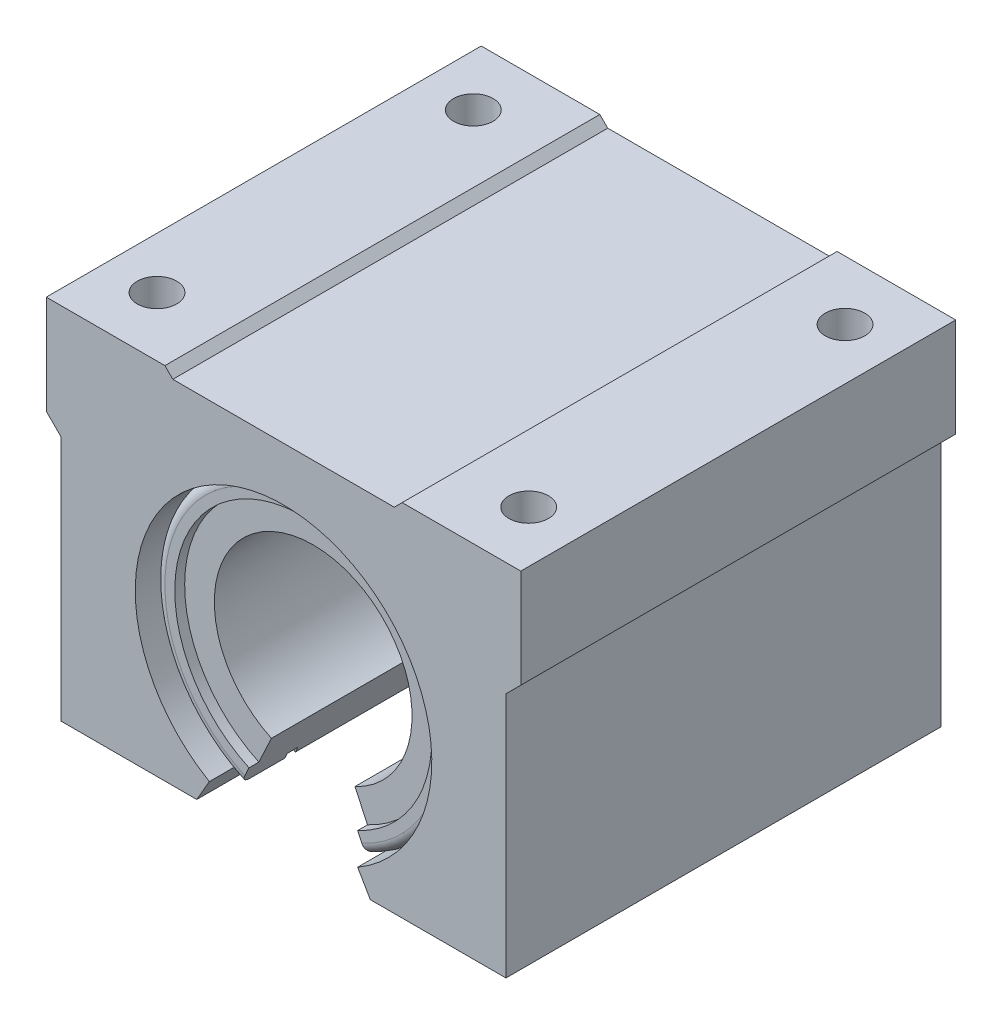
ISO-10303-21;
HEADER;
FILE_DESCRIPTION(('STEP AP214'),'2;1');
FILE_NAME('part.step','',(''),(''),'','','');
FILE_SCHEMA(('AUTOMOTIVE_DESIGN { 1 0 10303 214 1 1 1 1 }'));
ENDSEC;
DATA;
#1=APPLICATION_CONTEXT('core data for automotive mechanical design processes');
#2=APPLICATION_PROTOCOL_DEFINITION('international standard','automotive_design',2000,#1);
#3=PRODUCT_CONTEXT('',#1,'mechanical');
#4=PRODUCT('Part','Part','',(#3));
#5=PRODUCT_RELATED_PRODUCT_CATEGORY('part','',(#4));
#6=PRODUCT_DEFINITION_FORMATION('','',#4);
#7=PRODUCT_DEFINITION_CONTEXT('part definition',#1,'design');
#8=PRODUCT_DEFINITION('design','',#6,#7);
#9=PRODUCT_DEFINITION_SHAPE('','',#8);
#10=(LENGTH_UNIT() NAMED_UNIT(*) SI_UNIT(.MILLI.,.METRE.));
#11=(NAMED_UNIT(*) PLANE_ANGLE_UNIT() SI_UNIT($,.RADIAN.));
#12=(NAMED_UNIT(*) SI_UNIT($,.STERADIAN.) SOLID_ANGLE_UNIT());
#13=UNCERTAINTY_MEASURE_WITH_UNIT(LENGTH_MEASURE(1.E-05),#10,'distance_accuracy_value','');
#14=(GEOMETRIC_REPRESENTATION_CONTEXT(3) GLOBAL_UNCERTAINTY_ASSIGNED_CONTEXT((#13)) GLOBAL_UNIT_ASSIGNED_CONTEXT((#10,
#11,#12)) REPRESENTATION_CONTEXT('',''));
#15=CARTESIAN_POINT('',(0.,0.,0.));
#16=DIRECTION('',(0.,0.,1.));
#17=DIRECTION('',(1.,0.,0.));
#18=AXIS2_PLACEMENT_3D('',#15,#16,#17);
#19=CARTESIAN_POINT('',(0.,0.,50.));
#20=DIRECTION('',(0.,0.,-1.));
#21=DIRECTION('',(-1.,0.,0.));
#22=AXIS2_PLACEMENT_3D('',#19,#20,#21);
#23=CYLINDRICAL_SURFACE('',#22,25.);
#24=DIRECTION('',(0.,0.,-1.));
#25=VECTOR('',#24,1.);
#26=CARTESIAN_POINT('',(10.5654565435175,-22.6576946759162,50.));
#27=LINE('',#26,#25);
#28=CARTESIAN_POINT('',(10.5654565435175,-22.6576946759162,47.5));
#29=VERTEX_POINT('',#28);
#30=CARTESIAN_POINT('',(10.5654565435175,-22.6576946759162,-47.5));
#31=VERTEX_POINT('',#30);
#32=EDGE_CURVE('P0_E38',#29,#31,#27,.T.);
#33=ORIENTED_EDGE('',*,*,#32,.F.);
#34=CARTESIAN_POINT('',(0.,0.,47.5));
#35=DIRECTION('',(0.,0.,1.));
#36=DIRECTION('',(1.,0.,0.));
#37=AXIS2_PLACEMENT_3D('',#34,#35,#36);
#38=CIRCLE('',#37,25.);
#39=CARTESIAN_POINT('',(-10.5654565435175,-22.6576946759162,47.5));
#40=VERTEX_POINT('',#39);
#41=EDGE_CURVE('P0_E168',#29,#40,#38,.T.);
#42=ORIENTED_EDGE('',*,*,#41,.T.);
#43=DIRECTION('',(0.,0.,-1.));
#44=VECTOR('',#43,1.);
#45=CARTESIAN_POINT('',(-10.5654565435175,-22.6576946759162,50.));
#46=LINE('',#45,#44);
#47=CARTESIAN_POINT('',(-10.5654565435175,-22.6576946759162,-47.5));
#48=VERTEX_POINT('',#47);
#49=EDGE_CURVE('P0_E211',#48,#40,#46,.F.);
#50=ORIENTED_EDGE('',*,*,#49,.F.);
#51=CARTESIAN_POINT('',(0.,0.,-47.5));
#52=DIRECTION('',(0.,0.,-1.));
#53=DIRECTION('',(-1.,0.,0.));
#54=AXIS2_PLACEMENT_3D('',#51,#52,#53);
#55=CIRCLE('',#54,25.);
#56=EDGE_CURVE('P0_E166',#48,#31,#55,.T.);
#57=ORIENTED_EDGE('',*,*,#56,.T.);
#58=EDGE_LOOP('',(#33,#42,#50,#57));
#59=FACE_BOUND('',#58,.T.);
#60=ADVANCED_FACE('P0_F16',(#59),#23,.F.);
#61=CARTESIAN_POINT('',(0.,0.,-50.));
#62=DIRECTION('',(0.,0.,1.));
#63=DIRECTION('',(1.,0.,0.));
#64=AXIS2_PLACEMENT_3D('',#61,#62,#63);
#65=PLANE('',#64);
#66=CARTESIAN_POINT('',(0.,0.,-50.));
#67=DIRECTION('',(0.,0.,1.));
#68=DIRECTION('',(1.,0.,0.));
#69=AXIS2_PLACEMENT_3D('',#66,#67,#68);
#70=CIRCLE('',#69,35.);
#71=CARTESIAN_POINT('',(-14.7916391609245,-31.7207725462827,-50.));
#72=VERTEX_POINT('',#71);
#73=CARTESIAN_POINT('',(14.7916391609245,-31.7207725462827,-50.));
#74=VERTEX_POINT('',#73);
#75=EDGE_CURVE('P0_E202',#72,#74,#70,.F.);
#76=ORIENTED_EDGE('',*,*,#75,.T.);
#77=DIRECTION('',(-0.4226182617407,0.90630778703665,0.));
#78=VECTOR('',#77,1.);
#79=CARTESIAN_POINT('',(0.,0.,-50.));
#80=LINE('',#79,#78);
#81=CARTESIAN_POINT('',(13.7350935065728,-29.4550030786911,-50.));
#82=VERTEX_POINT('',#81);
#83=EDGE_CURVE('P0_E159',#74,#82,#80,.T.);
#84=ORIENTED_EDGE('',*,*,#83,.T.);
#85=CARTESIAN_POINT('',(0.,0.,-50.));
#86=DIRECTION('',(0.,0.,1.));
#87=DIRECTION('',(1.,0.,0.));
#88=AXIS2_PLACEMENT_3D('',#85,#86,#87);
#89=CIRCLE('',#88,32.5);
#90=CARTESIAN_POINT('',(-13.7350935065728,-29.4550030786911,-50.));
#91=VERTEX_POINT('',#90);
#92=EDGE_CURVE('P0_E228',#82,#91,#89,.T.);
#93=ORIENTED_EDGE('',*,*,#92,.T.);
#94=DIRECTION('',(-0.4226182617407,-0.90630778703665,0.));
#95=VECTOR('',#94,1.);
#96=CARTESIAN_POINT('',(0.,0.,-50.));
#97=LINE('',#96,#95);
#98=EDGE_CURVE('P0_E258',#91,#72,#97,.T.);
#99=ORIENTED_EDGE('',*,*,#98,.T.);
#100=EDGE_LOOP('',(#76,#84,#93,#99));
#101=FACE_BOUND('',#100,.T.);
#102=ADVANCED_FACE('P0_F257',(#101),#65,.F.);
#103=CARTESIAN_POINT('',(0.,0.,50.));
#104=DIRECTION('',(0.,0.,-1.));
#105=DIRECTION('',(-1.,0.,0.));
#106=AXIS2_PLACEMENT_3D('',#103,#104,#105);
#107=CYLINDRICAL_SURFACE('',#106,37.5);
#108=CARTESIAN_POINT('',(0.,0.,36.15));
#109=DIRECTION('',(0.,0.,1.));
#110=DIRECTION('',(1.,0.,0.));
#111=AXIS2_PLACEMENT_3D('',#108,#109,#110);
#112=CIRCLE('',#111,37.5);
#113=CARTESIAN_POINT('',(15.8481848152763,-33.9865420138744,36.15));
#114=VERTEX_POINT('',#113);
#115=CARTESIAN_POINT('',(-15.8481848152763,-33.9865420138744,36.15));
#116=VERTEX_POINT('',#115);
#117=EDGE_CURVE('P0_E187',#114,#116,#112,.T.);
#118=ORIENTED_EDGE('',*,*,#117,.F.);
#119=DIRECTION('',(0.,0.,1.));
#120=VECTOR('',#119,1.);
#121=CARTESIAN_POINT('',(15.8481848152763,-33.9865420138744,-50.));
#122=LINE('',#121,#120);
#123=CARTESIAN_POINT('',(15.8481848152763,-33.9865420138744,-36.15));
#124=VERTEX_POINT('',#123);
#125=EDGE_CURVE('P0_E268',#124,#114,#122,.T.);
#126=ORIENTED_EDGE('',*,*,#125,.F.);
#127=CARTESIAN_POINT('',(0.,0.,-36.15));
#128=DIRECTION('',(0.,0.,1.));
#129=DIRECTION('',(1.,0.,0.));
#130=AXIS2_PLACEMENT_3D('',#127,#128,#129);
#131=CIRCLE('',#130,37.5);
#132=CARTESIAN_POINT('',(-15.8481848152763,-33.9865420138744,-36.15));
#133=VERTEX_POINT('',#132);
#134=EDGE_CURVE('P0_E184',#124,#133,#131,.T.);
#135=ORIENTED_EDGE('',*,*,#134,.T.);
#136=DIRECTION('',(0.,0.,1.));
#137=VECTOR('',#136,1.);
#138=CARTESIAN_POINT('',(-15.8481848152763,-33.9865420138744,-50.));
#139=LINE('',#138,#137);
#140=EDGE_CURVE('P0_E273',#133,#116,#139,.T.);
#141=ORIENTED_EDGE('',*,*,#140,.T.);
#142=EDGE_LOOP('',(#118,#126,#135,#141));
#143=FACE_BOUND('',#142,.T.);
#144=ADVANCED_FACE('P0_F325',(#143),#107,.T.);
#145=CARTESIAN_POINT('',(0.,0.,-38.8));
#146=DIRECTION('',(0.,0.,1.));
#147=DIRECTION('',(1.,0.,0.));
#148=AXIS2_PLACEMENT_3D('',#145,#146,#147);
#149=CIRCLE('',#148,37.5);
#150=CARTESIAN_POINT('',(15.8481848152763,-33.9865420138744,-38.8));
#151=VERTEX_POINT('',#150);
#152=CARTESIAN_POINT('',(-15.8481848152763,-33.9865420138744,-38.8));
#153=VERTEX_POINT('',#152);
#154=EDGE_CURVE('P0_E181',#151,#153,#149,.T.);
#155=ORIENTED_EDGE('',*,*,#154,.F.);
#156=CARTESIAN_POINT('',(15.8481848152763,-33.9865420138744,-47.5));
#157=VERTEX_POINT('',#156);
#158=EDGE_CURVE('P0_E270',#157,#151,#122,.T.);
#159=ORIENTED_EDGE('',*,*,#158,.F.);
#160=CARTESIAN_POINT('',(0.,0.,-47.5));
#161=DIRECTION('',(0.,0.,1.));
#162=DIRECTION('',(1.,0.,0.));
#163=AXIS2_PLACEMENT_3D('',#160,#161,#162);
#164=CIRCLE('',#163,37.5);
#165=CARTESIAN_POINT('',(-15.8481848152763,-33.9865420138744,-47.5));
#166=VERTEX_POINT('',#165);
#167=EDGE_CURVE('P0_E199',#157,#166,#164,.T.);
#168=ORIENTED_EDGE('',*,*,#167,.T.);
#169=EDGE_CURVE('P0_E269',#166,#153,#139,.T.);
#170=ORIENTED_EDGE('',*,*,#169,.T.);
#171=EDGE_LOOP('',(#155,#159,#168,#170));
#172=FACE_BOUND('',#171,.T.);
#173=ADVANCED_FACE('P0_F333',(#172),#107,.T.);
#174=CARTESIAN_POINT('',(0.,0.,47.5));
#175=DIRECTION('',(0.,0.,1.));
#176=DIRECTION('',(1.,0.,0.));
#177=AXIS2_PLACEMENT_3D('',#174,#175,#176);
#178=CIRCLE('',#177,37.5);
#179=CARTESIAN_POINT('',(-15.8481848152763,-33.9865420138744,47.5));
#180=VERTEX_POINT('',#179);
#181=CARTESIAN_POINT('',(15.8481848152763,-33.9865420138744,47.5));
#182=VERTEX_POINT('',#181);
#183=EDGE_CURVE('P0_E206',#180,#182,#178,.F.);
#184=ORIENTED_EDGE('',*,*,#183,.T.);
#185=CARTESIAN_POINT('',(15.8481848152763,-33.9865420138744,38.8));
#186=VERTEX_POINT('',#185);
#187=EDGE_CURVE('P0_E266',#186,#182,#122,.T.);
#188=ORIENTED_EDGE('',*,*,#187,.F.);
#189=CARTESIAN_POINT('',(0.,0.,38.8));
#190=DIRECTION('',(0.,0.,1.));
#191=DIRECTION('',(1.,0.,0.));
#192=AXIS2_PLACEMENT_3D('',#189,#190,#191);
#193=CIRCLE('',#192,37.5);
#194=CARTESIAN_POINT('',(-15.8481848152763,-33.9865420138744,38.8));
#195=VERTEX_POINT('',#194);
#196=EDGE_CURVE('P0_E196',#186,#195,#193,.T.);
#197=ORIENTED_EDGE('',*,*,#196,.T.);
#198=EDGE_CURVE('P0_E262',#195,#180,#139,.T.);
#199=ORIENTED_EDGE('',*,*,#198,.T.);
#200=EDGE_LOOP('',(#184,#188,#197,#199));
#201=FACE_BOUND('',#200,.T.);
#202=ADVANCED_FACE('P0_F305',(#201),#107,.T.);
#203=CARTESIAN_POINT('',(0.,0.,50.));
#204=DIRECTION('',(0.,0.,1.));
#205=DIRECTION('',(1.,0.,0.));
#206=AXIS2_PLACEMENT_3D('',#203,#204,#205);
#207=PLANE('',#206);
#208=DIRECTION('',(-0.4226182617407,0.90630778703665,0.));
#209=VECTOR('',#208,1.);
#210=CARTESIAN_POINT('',(0.,0.,50.));
#211=LINE('',#210,#209);
#212=CARTESIAN_POINT('',(14.7916391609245,-31.7207725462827,50.));
#213=VERTEX_POINT('',#212);
#214=CARTESIAN_POINT('',(13.7350935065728,-29.4550030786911,50.));
#215=VERTEX_POINT('',#214);
#216=EDGE_CURVE('P0_E160',#213,#215,#211,.T.);
#217=ORIENTED_EDGE('',*,*,#216,.F.);
#218=CARTESIAN_POINT('',(0.,0.,50.));
#219=DIRECTION('',(0.,0.,1.));
#220=DIRECTION('',(1.,0.,0.));
#221=AXIS2_PLACEMENT_3D('',#218,#219,#220);
#222=CIRCLE('',#221,35.);
#223=CARTESIAN_POINT('',(-14.7916391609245,-31.7207725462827,50.));
#224=VERTEX_POINT('',#223);
#225=EDGE_CURVE('P0_E158',#213,#224,#222,.T.);
#226=ORIENTED_EDGE('',*,*,#225,.T.);
#227=DIRECTION('',(-0.4226182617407,-0.90630778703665,0.));
#228=VECTOR('',#227,1.);
#229=CARTESIAN_POINT('',(0.,0.,50.));
#230=LINE('',#229,#228);
#231=CARTESIAN_POINT('',(-13.7350935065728,-29.4550030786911,50.));
#232=VERTEX_POINT('',#231);
#233=EDGE_CURVE('P0_E141',#232,#224,#230,.T.);
#234=ORIENTED_EDGE('',*,*,#233,.F.);
#235=CARTESIAN_POINT('',(0.,0.,50.));
#236=DIRECTION('',(0.,0.,1.));
#237=DIRECTION('',(1.,0.,0.));
#238=AXIS2_PLACEMENT_3D('',#235,#236,#237);
#239=CIRCLE('',#238,32.5);
#240=EDGE_CURVE('P0_E156',#215,#232,#239,.T.);
#241=ORIENTED_EDGE('',*,*,#240,.F.);
#242=EDGE_LOOP('',(#217,#226,#234,#241));
#243=FACE_BOUND('',#242,.T.);
#244=ADVANCED_FACE('P0_F155',(#243),#207,.T.);
#245=CARTESIAN_POINT('',(-2.61861100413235E-13,-37.5,38.8));
#246=DIRECTION('',(0.,0.,-1.));
#247=DIRECTION('',(-1.,0.,0.));
#248=AXIS2_PLACEMENT_3D('',#245,#246,#247);
#249=PLANE('',#248);
#250=DIRECTION('',(0.4226182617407,-0.90630778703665,0.));
#251=VECTOR('',#250,1.);
#252=CARTESIAN_POINT('',(14.3633333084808,-30.8022676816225,38.8));
#253=LINE('',#252,#251);
#254=CARTESIAN_POINT('',(15.2142574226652,-32.6270803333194,38.8));
#255=VERTEX_POINT('',#254);
#256=EDGE_CURVE('P0_E253',#255,#186,#253,.T.);
#257=ORIENTED_EDGE('',*,*,#256,.F.);
#258=CARTESIAN_POINT('',(0.,0.,38.8));
#259=DIRECTION('',(0.,0.,1.));
#260=DIRECTION('',(1.,0.,0.));
#261=AXIS2_PLACEMENT_3D('',#258,#259,#260);
#262=CIRCLE('',#261,36.);
#263=CARTESIAN_POINT('',(-15.2142574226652,-32.6270803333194,38.8));
#264=VERTEX_POINT('',#263);
#265=EDGE_CURVE('P0_E193',#255,#264,#262,.T.);
#266=ORIENTED_EDGE('',*,*,#265,.T.);
#267=DIRECTION('',(0.4226182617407,0.90630778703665,0.));
#268=VECTOR('',#267,1.);
#269=CARTESIAN_POINT('',(-14.3633333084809,-30.8022676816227,38.8));
#270=LINE('',#269,#268);
#271=EDGE_CURVE('P0_E229',#195,#264,#270,.T.);
#272=ORIENTED_EDGE('',*,*,#271,.F.);
#273=ORIENTED_EDGE('',*,*,#196,.F.);
#274=EDGE_LOOP('',(#257,#266,#272,#273));
#275=FACE_BOUND('',#274,.T.);
#276=ADVANCED_FACE('P0_F303',(#275),#249,.T.);
#277=CARTESIAN_POINT('',(0.,0.,0.));
#278=DIRECTION('',(0.,0.,1.));
#279=DIRECTION('',(1.,0.,0.));
#280=AXIS2_PLACEMENT_3D('',#277,#278,#279);
#281=CYLINDRICAL_SURFACE('',#280,36.);
#282=DIRECTION('',(0.,0.,1.));
#283=VECTOR('',#282,1.);
#284=CARTESIAN_POINT('',(15.2142574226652,-32.6270803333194,0.));
#285=LINE('',#284,#283);
#286=CARTESIAN_POINT('',(15.2142574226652,-32.6270803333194,36.15));
#287=VERTEX_POINT('',#286);
#288=EDGE_CURVE('P0_E251',#287,#255,#285,.T.);
#289=ORIENTED_EDGE('',*,*,#288,.F.);
#290=CARTESIAN_POINT('',(0.,0.,36.15));
#291=DIRECTION('',(0.,0.,1.));
#292=DIRECTION('',(1.,0.,0.));
#293=AXIS2_PLACEMENT_3D('',#290,#291,#292);
#294=CIRCLE('',#293,36.);
#295=CARTESIAN_POINT('',(-15.2142574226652,-32.6270803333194,36.15));
#296=VERTEX_POINT('',#295);
#297=EDGE_CURVE('P0_E190',#287,#296,#294,.T.);
#298=ORIENTED_EDGE('',*,*,#297,.T.);
#299=DIRECTION('',(0.,0.,1.));
#300=VECTOR('',#299,1.);
#301=CARTESIAN_POINT('',(-15.2142574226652,-32.6270803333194,0.));
#302=LINE('',#301,#300);
#303=EDGE_CURVE('P0_E233',#264,#296,#302,.F.);
#304=ORIENTED_EDGE('',*,*,#303,.F.);
#305=ORIENTED_EDGE('',*,*,#265,.F.);
#306=EDGE_LOOP('',(#289,#298,#304,#305));
#307=FACE_BOUND('',#306,.T.);
#308=ADVANCED_FACE('P0_F298',(#307),#281,.T.);
#309=CARTESIAN_POINT('',(-2.51386656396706E-13,-36.,36.15));
#310=DIRECTION('',(0.,0.,1.));
#311=DIRECTION('',(1.,0.,0.));
#312=AXIS2_PLACEMENT_3D('',#309,#310,#311);
#313=PLANE('',#312);
#314=DIRECTION('',(-0.4226182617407,0.90630778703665,0.));
#315=VECTOR('',#314,1.);
#316=CARTESIAN_POINT('',(13.7887999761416,-29.5701769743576,36.15));
#317=LINE('',#316,#315);
#318=EDGE_CURVE('P0_E249',#114,#287,#317,.T.);
#319=ORIENTED_EDGE('',*,*,#318,.F.);
#320=ORIENTED_EDGE('',*,*,#117,.T.);
#321=DIRECTION('',(-0.4226182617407,-0.90630778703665,0.));
#322=VECTOR('',#321,1.);
#323=CARTESIAN_POINT('',(-13.7887999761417,-29.5701769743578,36.15));
#324=LINE('',#323,#322);
#325=EDGE_CURVE('P0_E285',#296,#116,#324,.T.);
#326=ORIENTED_EDGE('',*,*,#325,.F.);
#327=ORIENTED_EDGE('',*,*,#297,.F.);
#328=EDGE_LOOP('',(#319,#320,#326,#327));
#329=FACE_BOUND('',#328,.T.);
#330=ADVANCED_FACE('P0_F295',(#329),#313,.T.);
#331=CARTESIAN_POINT('',(-2.51386656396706E-13,-36.,-36.15));
#332=DIRECTION('',(0.,0.,-1.));
#333=DIRECTION('',(-1.,0.,0.));
#334=AXIS2_PLACEMENT_3D('',#331,#332,#333);
#335=PLANE('',#334);
#336=DIRECTION('',(0.4226182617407,-0.90630778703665,0.));
#337=VECTOR('',#336,1.);
#338=CARTESIAN_POINT('',(13.7887999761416,-29.5701769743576,-36.15));
#339=LINE('',#338,#337);
#340=CARTESIAN_POINT('',(15.2142574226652,-32.6270803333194,-36.15));
#341=VERTEX_POINT('',#340);
#342=EDGE_CURVE('P0_E247',#341,#124,#339,.T.);
#343=ORIENTED_EDGE('',*,*,#342,.F.);
#344=CARTESIAN_POINT('',(0.,0.,-36.15));
#345=DIRECTION('',(0.,0.,1.));
#346=DIRECTION('',(1.,0.,0.));
#347=AXIS2_PLACEMENT_3D('',#344,#345,#346);
#348=CIRCLE('',#347,36.);
#349=CARTESIAN_POINT('',(-15.2142574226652,-32.6270803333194,-36.15));
#350=VERTEX_POINT('',#349);
#351=EDGE_CURVE('P0_E175',#341,#350,#348,.T.);
#352=ORIENTED_EDGE('',*,*,#351,.T.);
#353=DIRECTION('',(0.4226182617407,0.90630778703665,0.));
#354=VECTOR('',#353,1.);
#355=CARTESIAN_POINT('',(-13.7887999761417,-29.5701769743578,-36.15));
#356=LINE('',#355,#354);
#357=EDGE_CURVE('P0_E283',#133,#350,#356,.T.);
#358=ORIENTED_EDGE('',*,*,#357,.F.);
#359=ORIENTED_EDGE('',*,*,#134,.F.);
#360=EDGE_LOOP('',(#343,#352,#358,#359));
#361=FACE_BOUND('',#360,.T.);
#362=ADVANCED_FACE('P0_F361',(#361),#335,.T.);
#363=CARTESIAN_POINT('',(-2.61861100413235E-13,-37.5,-38.8));
#364=DIRECTION('',(0.,0.,1.));
#365=DIRECTION('',(1.,0.,0.));
#366=AXIS2_PLACEMENT_3D('',#363,#364,#365);
#367=PLANE('',#366);
#368=DIRECTION('',(-0.4226182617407,0.90630778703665,0.));
#369=VECTOR('',#368,1.);
#370=CARTESIAN_POINT('',(14.3633333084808,-30.8022676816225,-38.8));
#371=LINE('',#370,#369);
#372=CARTESIAN_POINT('',(15.2142574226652,-32.6270803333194,-38.8));
#373=VERTEX_POINT('',#372);
#374=EDGE_CURVE('P0_E245',#151,#373,#371,.T.);
#375=ORIENTED_EDGE('',*,*,#374,.F.);
#376=ORIENTED_EDGE('',*,*,#154,.T.);
#377=DIRECTION('',(-0.4226182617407,-0.90630778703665,0.));
#378=VECTOR('',#377,1.);
#379=CARTESIAN_POINT('',(-14.3633333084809,-30.8022676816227,-38.8));
#380=LINE('',#379,#378);
#381=CARTESIAN_POINT('',(-15.2142574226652,-32.6270803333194,-38.8));
#382=VERTEX_POINT('',#381);
#383=EDGE_CURVE('P0_E281',#382,#153,#380,.T.);
#384=ORIENTED_EDGE('',*,*,#383,.F.);
#385=CARTESIAN_POINT('',(0.,0.,-38.8));
#386=DIRECTION('',(0.,0.,1.));
#387=DIRECTION('',(1.,0.,0.));
#388=AXIS2_PLACEMENT_3D('',#385,#386,#387);
#389=CIRCLE('',#388,36.);
#390=EDGE_CURVE('P0_E178',#373,#382,#389,.T.);
#391=ORIENTED_EDGE('',*,*,#390,.F.);
#392=EDGE_LOOP('',(#375,#376,#384,#391));
#393=FACE_BOUND('',#392,.T.);
#394=ADVANCED_FACE('P0_F353',(#393),#367,.T.);
#395=CARTESIAN_POINT('',(0.,0.,0.));
#396=DIRECTION('',(0.,0.,1.));
#397=DIRECTION('',(1.,0.,0.));
#398=AXIS2_PLACEMENT_3D('',#395,#396,#397);
#399=CYLINDRICAL_SURFACE('',#398,36.);
#400=DIRECTION('',(0.,0.,1.));
#401=VECTOR('',#400,1.);
#402=CARTESIAN_POINT('',(15.2142574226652,-32.6270803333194,0.));
#403=LINE('',#402,#401);
#404=EDGE_CURVE('P0_E243',#373,#341,#403,.T.);
#405=ORIENTED_EDGE('',*,*,#404,.F.);
#406=ORIENTED_EDGE('',*,*,#390,.T.);
#407=DIRECTION('',(0.,0.,1.));
#408=VECTOR('',#407,1.);
#409=CARTESIAN_POINT('',(-15.2142574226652,-32.6270803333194,0.));
#410=LINE('',#409,#408);
#411=EDGE_CURVE('P0_E279',#350,#382,#410,.F.);
#412=ORIENTED_EDGE('',*,*,#411,.F.);
#413=ORIENTED_EDGE('',*,*,#351,.F.);
#414=EDGE_LOOP('',(#405,#406,#412,#413));
#415=FACE_BOUND('',#414,.T.);
#416=ADVANCED_FACE('P0_F318',(#415),#399,.T.);
#417=CARTESIAN_POINT('',(0.,0.,-47.5));
#418=DIRECTION('',(0.,0.,1.));
#419=DIRECTION('',(1.,0.,0.));
#420=AXIS2_PLACEMENT_3D('',#417,#418,#419);
#421=TOROIDAL_SURFACE('',#420,35.,2.5);
#422=CARTESIAN_POINT('',(14.7916391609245,-31.7207725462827,-47.5));
#423=DIRECTION('',(0.906307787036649,0.4226182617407,0.));
#424=DIRECTION('',(-0.4226182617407,0.90630778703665,0.));
#425=AXIS2_PLACEMENT_3D('',#422,#423,#424);
#426=CIRCLE('',#425,2.5);
#427=EDGE_CURVE('P0_E241',#74,#157,#426,.F.);
#428=ORIENTED_EDGE('',*,*,#427,.F.);
#429=ORIENTED_EDGE('',*,*,#75,.F.);
#430=CARTESIAN_POINT('',(-14.7916391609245,-31.7207725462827,-47.5));
#431=DIRECTION('',(-0.906307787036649,0.4226182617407,0.));
#432=DIRECTION('',(-0.4226182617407,-0.90630778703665,0.));
#433=AXIS2_PLACEMENT_3D('',#430,#431,#432);
#434=CIRCLE('',#433,2.5);
#435=EDGE_CURVE('P0_E277',#166,#72,#434,.F.);
#436=ORIENTED_EDGE('',*,*,#435,.F.);
#437=ORIENTED_EDGE('',*,*,#167,.F.);
#438=EDGE_LOOP('',(#428,#429,#436,#437));
#439=FACE_BOUND('',#438,.T.);
#440=ADVANCED_FACE('P0_F310',(#439),#421,.T.);
#441=CARTESIAN_POINT('',(0.,0.,47.5));
#442=DIRECTION('',(0.,0.,1.));
#443=DIRECTION('',(1.,0.,0.));
#444=AXIS2_PLACEMENT_3D('',#441,#442,#443);
#445=TOROIDAL_SURFACE('',#444,35.,2.5);
#446=CARTESIAN_POINT('',(14.7916391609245,-31.7207725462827,47.5));
#447=DIRECTION('',(0.906307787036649,0.4226182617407,0.));
#448=DIRECTION('',(-0.4226182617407,0.90630778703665,0.));
#449=AXIS2_PLACEMENT_3D('',#446,#447,#448);
#450=CIRCLE('',#449,2.5);
#451=EDGE_CURVE('P0_E239',#182,#213,#450,.F.);
#452=ORIENTED_EDGE('',*,*,#451,.F.);
#453=ORIENTED_EDGE('',*,*,#183,.F.);
#454=CARTESIAN_POINT('',(-14.7916391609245,-31.7207725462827,47.5));
#455=DIRECTION('',(-0.906307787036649,0.4226182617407,0.));
#456=DIRECTION('',(-0.4226182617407,-0.90630778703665,0.));
#457=AXIS2_PLACEMENT_3D('',#454,#455,#456);
#458=CIRCLE('',#457,2.5);
#459=EDGE_CURVE('P0_E149',#224,#180,#458,.F.);
#460=ORIENTED_EDGE('',*,*,#459,.F.);
#461=ORIENTED_EDGE('',*,*,#225,.F.);
#462=EDGE_LOOP('',(#452,#453,#460,#461));
#463=FACE_BOUND('',#462,.T.);
#464=ADVANCED_FACE('P0_F18',(#463),#445,.T.);
#465=CARTESIAN_POINT('',(0.,0.,47.5));
#466=DIRECTION('',(0.,0.,1.));
#467=DIRECTION('',(1.,0.,0.));
#468=AXIS2_PLACEMENT_3D('',#465,#466,#467);
#469=CYLINDRICAL_SURFACE('',#468,32.5);
#470=CARTESIAN_POINT('',(0.,0.,47.5));
#471=DIRECTION('',(0.,0.,1.));
#472=DIRECTION('',(1.,0.,0.));
#473=AXIS2_PLACEMENT_3D('',#470,#471,#472);
#474=CIRCLE('',#473,32.5);
#475=CARTESIAN_POINT('',(13.7350935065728,-29.4550030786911,47.5));
#476=VERTEX_POINT('',#475);
#477=CARTESIAN_POINT('',(-13.7350935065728,-29.4550030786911,47.5));
#478=VERTEX_POINT('',#477);
#479=EDGE_CURVE('P0_E165',#476,#478,#474,.T.);
#480=ORIENTED_EDGE('',*,*,#479,.F.);
#481=DIRECTION('',(0.,0.,1.));
#482=VECTOR('',#481,1.);
#483=CARTESIAN_POINT('',(13.7350935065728,-29.4550030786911,47.5));
#484=LINE('',#483,#482);
#485=EDGE_CURVE('P0_E164',#476,#215,#484,.T.);
#486=ORIENTED_EDGE('',*,*,#485,.T.);
#487=ORIENTED_EDGE('',*,*,#240,.T.);
#488=DIRECTION('',(0.,0.,1.));
#489=VECTOR('',#488,1.);
#490=CARTESIAN_POINT('',(-13.7350935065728,-29.4550030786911,47.5));
#491=LINE('',#490,#489);
#492=EDGE_CURVE('P0_E138',#232,#478,#491,.F.);
#493=ORIENTED_EDGE('',*,*,#492,.T.);
#494=EDGE_LOOP('',(#480,#486,#487,#493));
#495=FACE_BOUND('',#494,.T.);
#496=ADVANCED_FACE('P0_F163',(#495),#469,.F.);
#497=CARTESIAN_POINT('',(0.,0.,47.5));
#498=DIRECTION('',(0.,0.,1.));
#499=DIRECTION('',(1.,0.,0.));
#500=AXIS2_PLACEMENT_3D('',#497,#498,#499);
#501=PLANE('',#500);
#502=DIRECTION('',(-0.4226182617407,0.90630778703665,0.));
#503=VECTOR('',#502,1.);
#504=CARTESIAN_POINT('',(0.,0.,47.5));
#505=LINE('',#504,#503);
#506=EDGE_CURVE('P0_E231',#476,#29,#505,.T.);
#507=ORIENTED_EDGE('',*,*,#506,.F.);
#508=ORIENTED_EDGE('',*,*,#479,.T.);
#509=DIRECTION('',(-0.4226182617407,-0.90630778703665,0.));
#510=VECTOR('',#509,1.);
#511=CARTESIAN_POINT('',(0.,0.,47.5));
#512=LINE('',#511,#510);
#513=EDGE_CURVE('P0_E144',#40,#478,#512,.T.);
#514=ORIENTED_EDGE('',*,*,#513,.F.);
#515=ORIENTED_EDGE('',*,*,#41,.F.);
#516=EDGE_LOOP('',(#507,#508,#514,#515));
#517=FACE_BOUND('',#516,.T.);
#518=ADVANCED_FACE('P0_F316',(#517),#501,.T.);
#519=CARTESIAN_POINT('',(0.,0.,-47.5));
#520=DIRECTION('',(0.,0.,-1.));
#521=DIRECTION('',(-1.,0.,0.));
#522=AXIS2_PLACEMENT_3D('',#519,#520,#521);
#523=CYLINDRICAL_SURFACE('',#522,32.5);
#524=DIRECTION('',(0.,0.,-1.));
#525=VECTOR('',#524,1.);
#526=CARTESIAN_POINT('',(13.7350935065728,-29.4550030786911,-47.5));
#527=LINE('',#526,#525);
#528=CARTESIAN_POINT('',(13.7350935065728,-29.4550030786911,-47.5));
#529=VERTEX_POINT('',#528);
#530=EDGE_CURVE('P0_E222',#529,#82,#527,.T.);
#531=ORIENTED_EDGE('',*,*,#530,.F.);
#532=CARTESIAN_POINT('',(0.,0.,-47.5));
#533=DIRECTION('',(0.,0.,1.));
#534=DIRECTION('',(1.,0.,0.));
#535=AXIS2_PLACEMENT_3D('',#532,#533,#534);
#536=CIRCLE('',#535,32.5);
#537=CARTESIAN_POINT('',(-13.7350935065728,-29.4550030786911,-47.5));
#538=VERTEX_POINT('',#537);
#539=EDGE_CURVE('P0_E171',#529,#538,#536,.T.);
#540=ORIENTED_EDGE('',*,*,#539,.T.);
#541=DIRECTION('',(0.,0.,-1.));
#542=VECTOR('',#541,1.);
#543=CARTESIAN_POINT('',(-13.7350935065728,-29.4550030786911,-47.5));
#544=LINE('',#543,#542);
#545=EDGE_CURVE('P0_E31',#91,#538,#544,.F.);
#546=ORIENTED_EDGE('',*,*,#545,.F.);
#547=ORIENTED_EDGE('',*,*,#92,.F.);
#548=EDGE_LOOP('',(#531,#540,#546,#547));
#549=FACE_BOUND('',#548,.T.);
#550=ADVANCED_FACE('P0_F226',(#549),#523,.F.);
#551=CARTESIAN_POINT('',(0.,0.,-47.5));
#552=DIRECTION('',(0.,0.,-1.));
#553=DIRECTION('',(1.,0.,0.));
#554=AXIS2_PLACEMENT_3D('',#551,#552,#553);
#555=PLANE('',#554);
#556=DIRECTION('',(0.4226182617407,-0.90630778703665,0.));
#557=VECTOR('',#556,1.);
#558=CARTESIAN_POINT('',(0.,0.,-47.5));
#559=LINE('',#558,#557);
#560=EDGE_CURVE('P0_E11',#31,#529,#559,.T.);
#561=ORIENTED_EDGE('',*,*,#560,.F.);
#562=ORIENTED_EDGE('',*,*,#56,.F.);
#563=DIRECTION('',(0.4226182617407,0.90630778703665,0.));
#564=VECTOR('',#563,1.);
#565=CARTESIAN_POINT('',(0.,0.,-47.5));
#566=LINE('',#565,#564);
#567=EDGE_CURVE('P0_E24',#538,#48,#566,.T.);
#568=ORIENTED_EDGE('',*,*,#567,.F.);
#569=ORIENTED_EDGE('',*,*,#539,.F.);
#570=EDGE_LOOP('',(#561,#562,#568,#569));
#571=FACE_BOUND('',#570,.T.);
#572=ADVANCED_FACE('P0_F219',(#571),#555,.T.);
#573=CARTESIAN_POINT('',(0.,0.,-50.));
#574=DIRECTION('',(-0.906307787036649,0.4226182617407,0.));
#575=DIRECTION('',(-0.4226182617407,-0.90630778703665,0.));
#576=AXIS2_PLACEMENT_3D('',#573,#574,#575);
#577=PLANE('',#576);
#578=ORIENTED_EDGE('',*,*,#271,.T.);
#579=ORIENTED_EDGE('',*,*,#303,.T.);
#580=ORIENTED_EDGE('',*,*,#325,.T.);
#581=ORIENTED_EDGE('',*,*,#140,.F.);
#582=ORIENTED_EDGE('',*,*,#357,.T.);
#583=ORIENTED_EDGE('',*,*,#411,.T.);
#584=ORIENTED_EDGE('',*,*,#383,.T.);
#585=ORIENTED_EDGE('',*,*,#169,.F.);
#586=ORIENTED_EDGE('',*,*,#435,.T.);
#587=ORIENTED_EDGE('',*,*,#98,.F.);
#588=ORIENTED_EDGE('',*,*,#545,.T.);
#589=ORIENTED_EDGE('',*,*,#567,.T.);
#590=ORIENTED_EDGE('',*,*,#49,.T.);
#591=ORIENTED_EDGE('',*,*,#513,.T.);
#592=ORIENTED_EDGE('',*,*,#492,.F.);
#593=ORIENTED_EDGE('',*,*,#233,.T.);
#594=ORIENTED_EDGE('',*,*,#459,.T.);
#595=ORIENTED_EDGE('',*,*,#198,.F.);
#596=EDGE_LOOP('',(#578,#579,#580,#581,#582,#583,#584,#585,#586,#587,#588,#589,#590,#591,#592,
#593,#594,#595));
#597=FACE_BOUND('',#596,.T.);
#598=ADVANCED_FACE('P0_F140',(#597),#577,.F.);
#599=CARTESIAN_POINT('',(0.,0.,-50.));
#600=DIRECTION('',(0.906307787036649,0.4226182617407,0.));
#601=DIRECTION('',(-0.4226182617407,0.90630778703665,0.));
#602=AXIS2_PLACEMENT_3D('',#599,#600,#601);
#603=PLANE('',#602);
#604=ORIENTED_EDGE('',*,*,#256,.T.);
#605=ORIENTED_EDGE('',*,*,#187,.T.);
#606=ORIENTED_EDGE('',*,*,#451,.T.);
#607=ORIENTED_EDGE('',*,*,#216,.T.);
#608=ORIENTED_EDGE('',*,*,#485,.F.);
#609=ORIENTED_EDGE('',*,*,#506,.T.);
#610=ORIENTED_EDGE('',*,*,#32,.T.);
#611=ORIENTED_EDGE('',*,*,#560,.T.);
#612=ORIENTED_EDGE('',*,*,#530,.T.);
#613=ORIENTED_EDGE('',*,*,#83,.F.);
#614=ORIENTED_EDGE('',*,*,#427,.T.);
#615=ORIENTED_EDGE('',*,*,#158,.T.);
#616=ORIENTED_EDGE('',*,*,#374,.T.);
#617=ORIENTED_EDGE('',*,*,#404,.T.);
#618=ORIENTED_EDGE('',*,*,#342,.T.);
#619=ORIENTED_EDGE('',*,*,#125,.T.);
#620=ORIENTED_EDGE('',*,*,#318,.T.);
#621=ORIENTED_EDGE('',*,*,#288,.T.);
#622=EDGE_LOOP('',(#604,#605,#606,#607,#608,#609,#610,#611,#612,#613,#614,#615,#616,#617,#618,
#619,#620,#621));
#623=FACE_BOUND('',#622,.T.);
#624=ADVANCED_FACE('P0_F221',(#623),#603,.F.);
#625=CLOSED_SHELL('',(#60,#102,#144,#173,#202,#244,#276,#308,#330,#362,#394,#416,#440,#464,#496,
#518,#550,#572,#598,#624));
#626=MANIFOLD_SOLID_BREP('P0_B1',#625);
#627=CARTESIAN_POINT('',(60.,53.,-55.));
#628=DIRECTION('',(0.,1.,0.));
#629=DIRECTION('',(-1.,0.,0.));
#630=AXIS2_PLACEMENT_3D('',#627,#628,#629);
#631=PLANE('',#630);
#632=CARTESIAN_POINT('',(-47.,53.,-40.));
#633=DIRECTION('',(0.,1.,0.));
#634=DIRECTION('',(-1.,0.,0.));
#635=AXIS2_PLACEMENT_3D('',#632,#633,#634);
#636=CIRCLE('',#635,5.);
#637=CARTESIAN_POINT('',(-52.,53.,-40.));
#638=VERTEX_POINT('',#637);
#639=EDGE_CURVE('P1_E329',#638,#638,#636,.T.);
#640=ORIENTED_EDGE('',*,*,#639,.F.);
#641=EDGE_LOOP('',(#640));
#642=FACE_BOUND('',#641,.T.);
#643=DIRECTION('',(0.,0.,1.));
#644=VECTOR('',#643,1.);
#645=CARTESIAN_POINT('',(-30.,53.,-55.));
#646=LINE('',#645,#644);
#647=CARTESIAN_POINT('',(-30.,53.,-55.));
#648=VERTEX_POINT('',#647);
#649=CARTESIAN_POINT('',(-30.,53.,55.));
#650=VERTEX_POINT('',#649);
#651=EDGE_CURVE('P1_E261',#648,#650,#646,.T.);
#652=ORIENTED_EDGE('',*,*,#651,.F.);
#653=DIRECTION('',(-1.,0.,0.));
#654=VECTOR('',#653,1.);
#655=CARTESIAN_POINT('',(60.,53.,-55.));
#656=LINE('',#655,#654);
#657=CARTESIAN_POINT('',(-60.,53.,-55.));
#658=VERTEX_POINT('',#657);
#659=EDGE_CURVE('P1_E276',#648,#658,#656,.T.);
#660=ORIENTED_EDGE('',*,*,#659,.T.);
#661=DIRECTION('',(0.,0.,1.));
#662=VECTOR('',#661,1.);
#663=CARTESIAN_POINT('',(-60.,53.,-55.));
#664=LINE('',#663,#662);
#665=CARTESIAN_POINT('',(-60.,53.,55.));
#666=VERTEX_POINT('',#665);
#667=EDGE_CURVE('P1_E190',#658,#666,#664,.T.);
#668=ORIENTED_EDGE('',*,*,#667,.T.);
#669=DIRECTION('',(-1.,0.,0.));
#670=VECTOR('',#669,1.);
#671=CARTESIAN_POINT('',(60.,53.,55.));
#672=LINE('',#671,#670);
#673=EDGE_CURVE('P1_E169',#650,#666,#672,.T.);
#674=ORIENTED_EDGE('',*,*,#673,.F.);
#675=EDGE_LOOP('',(#652,#660,#668,#674));
#676=FACE_BOUND('',#675,.T.);
#677=CARTESIAN_POINT('',(-47.,53.,40.));
#678=DIRECTION('',(0.,1.,0.));
#679=DIRECTION('',(-1.,0.,0.));
#680=AXIS2_PLACEMENT_3D('',#677,#678,#679);
#681=CIRCLE('',#680,5.);
#682=CARTESIAN_POINT('',(-52.,53.,40.));
#683=VERTEX_POINT('',#682);
#684=EDGE_CURVE('P1_E292',#683,#683,#681,.T.);
#685=ORIENTED_EDGE('',*,*,#684,.F.);
#686=EDGE_LOOP('',(#685));
#687=FACE_BOUND('',#686,.T.);
#688=ADVANCED_FACE('P1_F15',(#642,#676,#687),#631,.T.);
#689=CARTESIAN_POINT('',(0.,0.,-55.));
#690=DIRECTION('',(0.,0.,1.));
#691=DIRECTION('',(1.,0.,0.));
#692=AXIS2_PLACEMENT_3D('',#689,#690,#691);
#693=CYLINDRICAL_SURFACE('',#692,37.5);
#694=CARTESIAN_POINT('',(0.,0.,55.));
#695=DIRECTION('',(0.,0.,-1.));
#696=DIRECTION('',(1.,0.,0.));
#697=AXIS2_PLACEMENT_3D('',#694,#695,#696);
#698=CIRCLE('',#697,37.5);
#699=CARTESIAN_POINT('',(-18.75,-32.4759526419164,55.));
#700=VERTEX_POINT('',#699);
#701=CARTESIAN_POINT('',(18.75,-32.4759526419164,55.));
#702=VERTEX_POINT('',#701);
#703=EDGE_CURVE('P1_E150',#700,#702,#698,.T.);
#704=ORIENTED_EDGE('',*,*,#703,.F.);
#705=DIRECTION('',(0.,0.,1.));
#706=VECTOR('',#705,1.);
#707=CARTESIAN_POINT('',(-18.75,-32.4759526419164,-55.));
#708=LINE('',#707,#706);
#709=CARTESIAN_POINT('',(-18.75,-32.4759526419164,-55.));
#710=VERTEX_POINT('',#709);
#711=EDGE_CURVE('P1_E10',#710,#700,#708,.T.);
#712=ORIENTED_EDGE('',*,*,#711,.F.);
#713=CARTESIAN_POINT('',(0.,0.,-55.));
#714=DIRECTION('',(0.,0.,-1.));
#715=DIRECTION('',(1.,0.,0.));
#716=AXIS2_PLACEMENT_3D('',#713,#714,#715);
#717=CIRCLE('',#716,37.5);
#718=CARTESIAN_POINT('',(18.75,-32.4759526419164,-55.));
#719=VERTEX_POINT('',#718);
#720=EDGE_CURVE('P1_E184',#710,#719,#717,.T.);
#721=ORIENTED_EDGE('',*,*,#720,.T.);
#722=DIRECTION('',(0.,0.,1.));
#723=VECTOR('',#722,1.);
#724=CARTESIAN_POINT('',(18.75,-32.4759526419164,-55.));
#725=LINE('',#724,#723);
#726=EDGE_CURVE('P1_E19',#719,#702,#725,.T.);
#727=ORIENTED_EDGE('',*,*,#726,.T.);
#728=EDGE_LOOP('',(#704,#712,#721,#727));
#729=FACE_BOUND('',#728,.T.);
#730=ADVANCED_FACE('P1_F17',(#729),#693,.F.);
#731=CARTESIAN_POINT('',(-18.75,-32.4759526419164,-55.));
#732=DIRECTION('',(0.866025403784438,-0.500000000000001,0.));
#733=DIRECTION('',(0.500000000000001,0.866025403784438,0.));
#734=AXIS2_PLACEMENT_3D('',#731,#732,#733);
#735=PLANE('',#734);
#736=DIRECTION('',(0.500000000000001,0.866025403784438,0.));
#737=VECTOR('',#736,1.);
#738=CARTESIAN_POINT('',(-18.75,-32.4759526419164,55.));
#739=LINE('',#738,#737);
#740=CARTESIAN_POINT('',(-21.9393102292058,-38.,55.));
#741=VERTEX_POINT('',#740);
#742=EDGE_CURVE('P1_E182',#741,#700,#739,.T.);
#743=ORIENTED_EDGE('',*,*,#742,.F.);
#744=DIRECTION('',(0.,0.,1.));
#745=VECTOR('',#744,1.);
#746=CARTESIAN_POINT('',(-21.9393102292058,-38.,-55.));
#747=LINE('',#746,#745);
#748=CARTESIAN_POINT('',(-21.9393102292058,-38.,-55.));
#749=VERTEX_POINT('',#748);
#750=EDGE_CURVE('P1_E24',#749,#741,#747,.T.);
#751=ORIENTED_EDGE('',*,*,#750,.F.);
#752=DIRECTION('',(0.500000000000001,0.866025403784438,0.));
#753=VECTOR('',#752,1.);
#754=CARTESIAN_POINT('',(-18.75,-32.4759526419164,-55.));
#755=LINE('',#754,#753);
#756=EDGE_CURVE('P1_E140',#749,#710,#755,.T.);
#757=ORIENTED_EDGE('',*,*,#756,.T.);
#758=ORIENTED_EDGE('',*,*,#711,.T.);
#759=EDGE_LOOP('',(#743,#751,#757,#758));
#760=FACE_BOUND('',#759,.T.);
#761=ADVANCED_FACE('P1_F205',(#760),#735,.T.);
#762=CARTESIAN_POINT('',(-56.25,-38.,-55.));
#763=DIRECTION('',(0.,-1.,0.));
#764=DIRECTION('',(1.,0.,0.));
#765=AXIS2_PLACEMENT_3D('',#762,#763,#764);
#766=PLANE('',#765);
#767=DIRECTION('',(1.,0.,0.));
#768=VECTOR('',#767,1.);
#769=CARTESIAN_POINT('',(-56.25,-38.,55.));
#770=LINE('',#769,#768);
#771=CARTESIAN_POINT('',(-56.25,-38.,55.));
#772=VERTEX_POINT('',#771);
#773=EDGE_CURVE('P1_E126',#772,#741,#770,.T.);
#774=ORIENTED_EDGE('',*,*,#773,.F.);
#775=DIRECTION('',(0.,0.,1.));
#776=VECTOR('',#775,1.);
#777=CARTESIAN_POINT('',(-56.25,-38.,-55.));
#778=LINE('',#777,#776);
#779=CARTESIAN_POINT('',(-56.25,-38.,-55.));
#780=VERTEX_POINT('',#779);
#781=EDGE_CURVE('P1_E120',#780,#772,#778,.T.);
#782=ORIENTED_EDGE('',*,*,#781,.F.);
#783=DIRECTION('',(1.,0.,0.));
#784=VECTOR('',#783,1.);
#785=CARTESIAN_POINT('',(-56.25,-38.,-55.));
#786=LINE('',#785,#784);
#787=EDGE_CURVE('P1_E123',#780,#749,#786,.T.);
#788=ORIENTED_EDGE('',*,*,#787,.T.);
#789=ORIENTED_EDGE('',*,*,#750,.T.);
#790=EDGE_LOOP('',(#774,#782,#788,#789));
#791=FACE_BOUND('',#790,.T.);
#792=ADVANCED_FACE('P1_F122',(#791),#766,.T.);
#793=CARTESIAN_POINT('',(-56.25,24.25,-55.));
#794=DIRECTION('',(-1.,0.,0.));
#795=DIRECTION('',(0.,0.,1.));
#796=AXIS2_PLACEMENT_3D('',#793,#794,#795);
#797=PLANE('',#796);
#798=DIRECTION('',(0.,-1.,0.));
#799=VECTOR('',#798,1.);
#800=CARTESIAN_POINT('',(-56.25,24.25,55.));
#801=LINE('',#800,#799);
#802=CARTESIAN_POINT('',(-56.25,24.25,55.));
#803=VERTEX_POINT('',#802);
#804=EDGE_CURVE('P1_E179',#803,#772,#801,.T.);
#805=ORIENTED_EDGE('',*,*,#804,.F.);
#806=DIRECTION('',(0.,0.,1.));
#807=VECTOR('',#806,1.);
#808=CARTESIAN_POINT('',(-56.25,24.25,-55.));
#809=LINE('',#808,#807);
#810=CARTESIAN_POINT('',(-56.25,24.25,-55.));
#811=VERTEX_POINT('',#810);
#812=EDGE_CURVE('P1_E131',#811,#803,#809,.T.);
#813=ORIENTED_EDGE('',*,*,#812,.F.);
#814=DIRECTION('',(0.,-1.,0.));
#815=VECTOR('',#814,1.);
#816=CARTESIAN_POINT('',(-56.25,24.25,-55.));
#817=LINE('',#816,#815);
#818=EDGE_CURVE('P1_E138',#811,#780,#817,.T.);
#819=ORIENTED_EDGE('',*,*,#818,.T.);
#820=ORIENTED_EDGE('',*,*,#781,.T.);
#821=EDGE_LOOP('',(#805,#813,#819,#820));
#822=FACE_BOUND('',#821,.T.);
#823=ADVANCED_FACE('P1_F142',(#822),#797,.T.);
#824=CARTESIAN_POINT('',(-60.,28.,-55.));
#825=DIRECTION('',(-0.707106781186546,-0.707106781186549,0.));
#826=DIRECTION('',(0.707106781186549,-0.707106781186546,0.));
#827=AXIS2_PLACEMENT_3D('',#824,#825,#826);
#828=PLANE('',#827);
#829=DIRECTION('',(0.707106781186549,-0.707106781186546,0.));
#830=VECTOR('',#829,1.);
#831=CARTESIAN_POINT('',(-60.,28.,55.));
#832=LINE('',#831,#830);
#833=CARTESIAN_POINT('',(-60.,28.,55.));
#834=VERTEX_POINT('',#833);
#835=EDGE_CURVE('P1_E176',#834,#803,#832,.T.);
#836=ORIENTED_EDGE('',*,*,#835,.F.);
#837=DIRECTION('',(0.,0.,1.));
#838=VECTOR('',#837,1.);
#839=CARTESIAN_POINT('',(-60.,28.,-55.));
#840=LINE('',#839,#838);
#841=CARTESIAN_POINT('',(-60.,28.,-55.));
#842=VERTEX_POINT('',#841);
#843=EDGE_CURVE('P1_E188',#842,#834,#840,.T.);
#844=ORIENTED_EDGE('',*,*,#843,.F.);
#845=DIRECTION('',(0.707106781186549,-0.707106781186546,0.));
#846=VECTOR('',#845,1.);
#847=CARTESIAN_POINT('',(-60.,28.,-55.));
#848=LINE('',#847,#846);
#849=EDGE_CURVE('P1_E143',#842,#811,#848,.T.);
#850=ORIENTED_EDGE('',*,*,#849,.T.);
#851=ORIENTED_EDGE('',*,*,#812,.T.);
#852=EDGE_LOOP('',(#836,#844,#850,#851));
#853=FACE_BOUND('',#852,.T.);
#854=ADVANCED_FACE('P1_F235',(#853),#828,.T.);
#855=CARTESIAN_POINT('',(-60.,53.,-55.));
#856=DIRECTION('',(-1.,0.,0.));
#857=DIRECTION('',(0.,-1.,0.));
#858=AXIS2_PLACEMENT_3D('',#855,#856,#857);
#859=PLANE('',#858);
#860=DIRECTION('',(0.,-1.,0.));
#861=VECTOR('',#860,1.);
#862=CARTESIAN_POINT('',(-60.,53.,55.));
#863=LINE('',#862,#861);
#864=EDGE_CURVE('P1_E173',#666,#834,#863,.T.);
#865=ORIENTED_EDGE('',*,*,#864,.F.);
#866=ORIENTED_EDGE('',*,*,#667,.F.);
#867=DIRECTION('',(0.,-1.,0.));
#868=VECTOR('',#867,1.);
#869=CARTESIAN_POINT('',(-60.,53.,-55.));
#870=LINE('',#869,#868);
#871=EDGE_CURVE('P1_E145',#658,#842,#870,.T.);
#872=ORIENTED_EDGE('',*,*,#871,.T.);
#873=ORIENTED_EDGE('',*,*,#843,.T.);
#874=EDGE_LOOP('',(#865,#866,#872,#873));
#875=FACE_BOUND('',#874,.T.);
#876=ADVANCED_FACE('P1_F227',(#875),#859,.T.);
#877=CARTESIAN_POINT('',(47.,53.,40.));
#878=DIRECTION('',(0.,1.,0.));
#879=DIRECTION('',(-1.,0.,0.));
#880=AXIS2_PLACEMENT_3D('',#877,#878,#879);
#881=CIRCLE('',#880,5.);
#882=CARTESIAN_POINT('',(42.,53.,40.));
#883=VERTEX_POINT('',#882);
#884=EDGE_CURVE('P1_E240',#883,#883,#881,.T.);
#885=ORIENTED_EDGE('',*,*,#884,.F.);
#886=EDGE_LOOP('',(#885));
#887=FACE_BOUND('',#886,.T.);
#888=CARTESIAN_POINT('',(47.,53.,-40.));
#889=DIRECTION('',(0.,1.,0.));
#890=DIRECTION('',(-1.,0.,0.));
#891=AXIS2_PLACEMENT_3D('',#888,#889,#890);
#892=CIRCLE('',#891,5.);
#893=CARTESIAN_POINT('',(42.,53.,-40.));
#894=VERTEX_POINT('',#893);
#895=EDGE_CURVE('P1_E244',#894,#894,#892,.T.);
#896=ORIENTED_EDGE('',*,*,#895,.F.);
#897=EDGE_LOOP('',(#896));
#898=FACE_BOUND('',#897,.T.);
#899=DIRECTION('',(0.,0.,1.));
#900=VECTOR('',#899,1.);
#901=CARTESIAN_POINT('',(30.,53.,-55.));
#902=LINE('',#901,#900);
#903=CARTESIAN_POINT('',(30.,53.,-55.));
#904=VERTEX_POINT('',#903);
#905=CARTESIAN_POINT('',(30.,53.,55.));
#906=VERTEX_POINT('',#905);
#907=EDGE_CURVE('P1_E250',#904,#906,#902,.T.);
#908=ORIENTED_EDGE('',*,*,#907,.T.);
#909=CARTESIAN_POINT('',(60.,53.,55.));
#910=VERTEX_POINT('',#909);
#911=EDGE_CURVE('P1_E170',#910,#906,#672,.T.);
#912=ORIENTED_EDGE('',*,*,#911,.F.);
#913=DIRECTION('',(0.,0.,1.));
#914=VECTOR('',#913,1.);
#915=CARTESIAN_POINT('',(60.,53.,-55.));
#916=LINE('',#915,#914);
#917=CARTESIAN_POINT('',(60.,53.,-55.));
#918=VERTEX_POINT('',#917);
#919=EDGE_CURVE('P1_E193',#918,#910,#916,.T.);
#920=ORIENTED_EDGE('',*,*,#919,.F.);
#921=EDGE_CURVE('P1_E253',#918,#904,#656,.T.);
#922=ORIENTED_EDGE('',*,*,#921,.T.);
#923=EDGE_LOOP('',(#908,#912,#920,#922));
#924=FACE_BOUND('',#923,.T.);
#925=ADVANCED_FACE('P1_F218',(#887,#898,#924),#631,.T.);
#926=CARTESIAN_POINT('',(60.,53.,-55.));
#927=DIRECTION('',(1.,0.,0.));
#928=DIRECTION('',(0.,0.,-1.));
#929=AXIS2_PLACEMENT_3D('',#926,#927,#928);
#930=PLANE('',#929);
#931=DIRECTION('',(0.,1.,0.));
#932=VECTOR('',#931,1.);
#933=CARTESIAN_POINT('',(60.,53.,55.));
#934=LINE('',#933,#932);
#935=CARTESIAN_POINT('',(60.,28.,55.));
#936=VERTEX_POINT('',#935);
#937=EDGE_CURVE('P1_E166',#936,#910,#934,.T.);
#938=ORIENTED_EDGE('',*,*,#937,.F.);
#939=DIRECTION('',(0.,0.,1.));
#940=VECTOR('',#939,1.);
#941=CARTESIAN_POINT('',(60.,28.,-55.));
#942=LINE('',#941,#940);
#943=CARTESIAN_POINT('',(60.,28.,-55.));
#944=VERTEX_POINT('',#943);
#945=EDGE_CURVE('P1_E195',#944,#936,#942,.T.);
#946=ORIENTED_EDGE('',*,*,#945,.F.);
#947=DIRECTION('',(0.,1.,0.));
#948=VECTOR('',#947,1.);
#949=CARTESIAN_POINT('',(60.,53.,-55.));
#950=LINE('',#949,#948);
#951=EDGE_CURVE('P1_E271',#944,#918,#950,.T.);
#952=ORIENTED_EDGE('',*,*,#951,.T.);
#953=ORIENTED_EDGE('',*,*,#919,.T.);
#954=EDGE_LOOP('',(#938,#946,#952,#953));
#955=FACE_BOUND('',#954,.T.);
#956=ADVANCED_FACE('P1_F226',(#955),#930,.T.);
#957=CARTESIAN_POINT('',(60.,28.,-55.));
#958=DIRECTION('',(0.707106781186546,-0.707106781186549,0.));
#959=DIRECTION('',(0.707106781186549,0.707106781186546,0.));
#960=AXIS2_PLACEMENT_3D('',#957,#958,#959);
#961=PLANE('',#960);
#962=DIRECTION('',(0.707106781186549,0.707106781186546,0.));
#963=VECTOR('',#962,1.);
#964=CARTESIAN_POINT('',(60.,28.,55.));
#965=LINE('',#964,#963);
#966=CARTESIAN_POINT('',(56.25,24.25,55.));
#967=VERTEX_POINT('',#966);
#968=EDGE_CURVE('P1_E163',#967,#936,#965,.T.);
#969=ORIENTED_EDGE('',*,*,#968,.F.);
#970=DIRECTION('',(0.,0.,1.));
#971=VECTOR('',#970,1.);
#972=CARTESIAN_POINT('',(56.25,24.25,-55.));
#973=LINE('',#972,#971);
#974=CARTESIAN_POINT('',(56.25,24.25,-55.));
#975=VERTEX_POINT('',#974);
#976=EDGE_CURVE('P1_E197',#975,#967,#973,.T.);
#977=ORIENTED_EDGE('',*,*,#976,.F.);
#978=DIRECTION('',(0.707106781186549,0.707106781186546,0.));
#979=VECTOR('',#978,1.);
#980=CARTESIAN_POINT('',(60.,28.,-55.));
#981=LINE('',#980,#979);
#982=EDGE_CURVE('P1_E281',#975,#944,#981,.T.);
#983=ORIENTED_EDGE('',*,*,#982,.T.);
#984=ORIENTED_EDGE('',*,*,#945,.T.);
#985=EDGE_LOOP('',(#969,#977,#983,#984));
#986=FACE_BOUND('',#985,.T.);
#987=ADVANCED_FACE('P1_F233',(#986),#961,.T.);
#988=CARTESIAN_POINT('',(56.25,24.25,-55.));
#989=DIRECTION('',(1.,0.,0.));
#990=DIRECTION('',(0.,1.,0.));
#991=AXIS2_PLACEMENT_3D('',#988,#989,#990);
#992=PLANE('',#991);
#993=DIRECTION('',(0.,1.,0.));
#994=VECTOR('',#993,1.);
#995=CARTESIAN_POINT('',(56.25,24.25,55.));
#996=LINE('',#995,#994);
#997=CARTESIAN_POINT('',(56.25,-38.,55.));
#998=VERTEX_POINT('',#997);
#999=EDGE_CURVE('P1_E160',#998,#967,#996,.T.);
#1000=ORIENTED_EDGE('',*,*,#999,.F.);
#1001=DIRECTION('',(0.,0.,1.));
#1002=VECTOR('',#1001,1.);
#1003=CARTESIAN_POINT('',(56.25,-38.,-55.));
#1004=LINE('',#1003,#1002);
#1005=CARTESIAN_POINT('',(56.25,-38.,-55.));
#1006=VERTEX_POINT('',#1005);
#1007=EDGE_CURVE('P1_E199',#1006,#998,#1004,.T.);
#1008=ORIENTED_EDGE('',*,*,#1007,.F.);
#1009=DIRECTION('',(0.,1.,0.));
#1010=VECTOR('',#1009,1.);
#1011=CARTESIAN_POINT('',(56.25,24.25,-55.));
#1012=LINE('',#1011,#1010);
#1013=EDGE_CURVE('P1_E283',#1006,#975,#1012,.T.);
#1014=ORIENTED_EDGE('',*,*,#1013,.T.);
#1015=ORIENTED_EDGE('',*,*,#976,.T.);
#1016=EDGE_LOOP('',(#1000,#1008,#1014,#1015));
#1017=FACE_BOUND('',#1016,.T.);
#1018=ADVANCED_FACE('P1_F575',(#1017),#992,.T.);
#1019=CARTESIAN_POINT('',(56.25,-38.,-55.));
#1020=DIRECTION('',(0.,-1.,0.));
#1021=DIRECTION('',(0.,0.,-1.));
#1022=AXIS2_PLACEMENT_3D('',#1019,#1020,#1021);
#1023=PLANE('',#1022);
#1024=DIRECTION('',(1.,0.,0.));
#1025=VECTOR('',#1024,1.);
#1026=CARTESIAN_POINT('',(56.25,-38.,55.));
#1027=LINE('',#1026,#1025);
#1028=CARTESIAN_POINT('',(21.9393102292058,-38.,55.));
#1029=VERTEX_POINT('',#1028);
#1030=EDGE_CURVE('P1_E157',#1029,#998,#1027,.T.);
#1031=ORIENTED_EDGE('',*,*,#1030,.F.);
#1032=DIRECTION('',(0.,0.,1.));
#1033=VECTOR('',#1032,1.);
#1034=CARTESIAN_POINT('',(21.9393102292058,-38.,-55.));
#1035=LINE('',#1034,#1033);
#1036=CARTESIAN_POINT('',(21.9393102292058,-38.,-55.));
#1037=VERTEX_POINT('',#1036);
#1038=EDGE_CURVE('P1_E200',#1037,#1029,#1035,.T.);
#1039=ORIENTED_EDGE('',*,*,#1038,.F.);
#1040=DIRECTION('',(1.,0.,0.));
#1041=VECTOR('',#1040,1.);
#1042=CARTESIAN_POINT('',(56.25,-38.,-55.));
#1043=LINE('',#1042,#1041);
#1044=EDGE_CURVE('P1_E286',#1037,#1006,#1043,.T.);
#1045=ORIENTED_EDGE('',*,*,#1044,.T.);
#1046=ORIENTED_EDGE('',*,*,#1007,.T.);
#1047=EDGE_LOOP('',(#1031,#1039,#1045,#1046));
#1048=FACE_BOUND('',#1047,.T.);
#1049=ADVANCED_FACE('P1_F568',(#1048),#1023,.T.);
#1050=CARTESIAN_POINT('',(18.75,-32.4759526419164,-55.));
#1051=DIRECTION('',(-0.866025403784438,-0.500000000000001,0.));
#1052=DIRECTION('',(0.500000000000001,-0.866025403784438,0.));
#1053=AXIS2_PLACEMENT_3D('',#1050,#1051,#1052);
#1054=PLANE('',#1053);
#1055=DIRECTION('',(0.500000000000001,-0.866025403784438,0.));
#1056=VECTOR('',#1055,1.);
#1057=CARTESIAN_POINT('',(18.75,-32.4759526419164,55.));
#1058=LINE('',#1057,#1056);
#1059=EDGE_CURVE('P1_E153',#702,#1029,#1058,.T.);
#1060=ORIENTED_EDGE('',*,*,#1059,.F.);
#1061=ORIENTED_EDGE('',*,*,#726,.F.);
#1062=DIRECTION('',(0.500000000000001,-0.866025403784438,0.));
#1063=VECTOR('',#1062,1.);
#1064=CARTESIAN_POINT('',(18.75,-32.4759526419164,-55.));
#1065=LINE('',#1064,#1063);
#1066=EDGE_CURVE('P1_E289',#719,#1037,#1065,.T.);
#1067=ORIENTED_EDGE('',*,*,#1066,.T.);
#1068=ORIENTED_EDGE('',*,*,#1038,.T.);
#1069=EDGE_LOOP('',(#1060,#1061,#1067,#1068));
#1070=FACE_BOUND('',#1069,.T.);
#1071=ADVANCED_FACE('P1_F202',(#1070),#1054,.T.);
#1072=CARTESIAN_POINT('',(0.,0.,-55.));
#1073=DIRECTION('',(0.,0.,1.));
#1074=DIRECTION('',(1.,0.,0.));
#1075=AXIS2_PLACEMENT_3D('',#1072,#1073,#1074);
#1076=PLANE('',#1075);
#1077=ORIENTED_EDGE('',*,*,#659,.F.);
#1078=DIRECTION('',(0.707106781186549,-0.707106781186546,0.));
#1079=VECTOR('',#1078,1.);
#1080=CARTESIAN_POINT('',(-28.,51.,-55.));
#1081=LINE('',#1080,#1079);
#1082=CARTESIAN_POINT('',(-28.,51.,-55.));
#1083=VERTEX_POINT('',#1082);
#1084=EDGE_CURVE('P1_E309',#648,#1083,#1081,.T.);
#1085=ORIENTED_EDGE('',*,*,#1084,.T.);
#1086=DIRECTION('',(1.,0.,0.));
#1087=VECTOR('',#1086,1.);
#1088=CARTESIAN_POINT('',(28.,51.,-55.));
#1089=LINE('',#1088,#1087);
#1090=CARTESIAN_POINT('',(28.,51.,-55.));
#1091=VERTEX_POINT('',#1090);
#1092=EDGE_CURVE('P1_E316',#1083,#1091,#1089,.T.);
#1093=ORIENTED_EDGE('',*,*,#1092,.T.);
#1094=DIRECTION('',(0.707106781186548,0.707106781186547,0.));
#1095=VECTOR('',#1094,1.);
#1096=CARTESIAN_POINT('',(30.,53.,-55.));
#1097=LINE('',#1096,#1095);
#1098=EDGE_CURVE('P1_E275',#1091,#904,#1097,.T.);
#1099=ORIENTED_EDGE('',*,*,#1098,.T.);
#1100=ORIENTED_EDGE('',*,*,#921,.F.);
#1101=ORIENTED_EDGE('',*,*,#951,.F.);
#1102=ORIENTED_EDGE('',*,*,#982,.F.);
#1103=ORIENTED_EDGE('',*,*,#1013,.F.);
#1104=ORIENTED_EDGE('',*,*,#1044,.F.);
#1105=ORIENTED_EDGE('',*,*,#1066,.F.);
#1106=ORIENTED_EDGE('',*,*,#720,.F.);
#1107=ORIENTED_EDGE('',*,*,#756,.F.);
#1108=ORIENTED_EDGE('',*,*,#787,.F.);
#1109=ORIENTED_EDGE('',*,*,#818,.F.);
#1110=ORIENTED_EDGE('',*,*,#849,.F.);
#1111=ORIENTED_EDGE('',*,*,#871,.F.);
#1112=EDGE_LOOP('',(#1077,#1085,#1093,#1099,#1100,#1101,#1102,#1103,#1104,#1105,#1106,#1107,
#1108,#1109,#1110,#1111));
#1113=FACE_BOUND('',#1112,.T.);
#1114=ADVANCED_FACE('P1_F136',(#1113),#1076,.F.);
#1115=CARTESIAN_POINT('',(0.,0.,55.));
#1116=DIRECTION('',(0.,0.,1.));
#1117=DIRECTION('',(1.,0.,0.));
#1118=AXIS2_PLACEMENT_3D('',#1115,#1116,#1117);
#1119=PLANE('',#1118);
#1120=DIRECTION('',(0.707106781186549,-0.707106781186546,0.));
#1121=VECTOR('',#1120,1.);
#1122=CARTESIAN_POINT('',(-28.,51.,55.));
#1123=LINE('',#1122,#1121);
#1124=CARTESIAN_POINT('',(-28.,51.,55.));
#1125=VERTEX_POINT('',#1124);
#1126=EDGE_CURVE('P1_E32',#650,#1125,#1123,.T.);
#1127=ORIENTED_EDGE('',*,*,#1126,.F.);
#1128=ORIENTED_EDGE('',*,*,#673,.T.);
#1129=ORIENTED_EDGE('',*,*,#864,.T.);
#1130=ORIENTED_EDGE('',*,*,#835,.T.);
#1131=ORIENTED_EDGE('',*,*,#804,.T.);
#1132=ORIENTED_EDGE('',*,*,#773,.T.);
#1133=ORIENTED_EDGE('',*,*,#742,.T.);
#1134=ORIENTED_EDGE('',*,*,#703,.T.);
#1135=ORIENTED_EDGE('',*,*,#1059,.T.);
#1136=ORIENTED_EDGE('',*,*,#1030,.T.);
#1137=ORIENTED_EDGE('',*,*,#999,.T.);
#1138=ORIENTED_EDGE('',*,*,#968,.T.);
#1139=ORIENTED_EDGE('',*,*,#937,.T.);
#1140=ORIENTED_EDGE('',*,*,#911,.T.);
#1141=DIRECTION('',(0.707106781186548,0.707106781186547,0.));
#1142=VECTOR('',#1141,1.);
#1143=CARTESIAN_POINT('',(30.,53.,55.));
#1144=LINE('',#1143,#1142);
#1145=CARTESIAN_POINT('',(28.,51.,55.));
#1146=VERTEX_POINT('',#1145);
#1147=EDGE_CURVE('P1_E266',#1146,#906,#1144,.T.);
#1148=ORIENTED_EDGE('',*,*,#1147,.F.);
#1149=DIRECTION('',(1.,0.,0.));
#1150=VECTOR('',#1149,1.);
#1151=CARTESIAN_POINT('',(28.,51.,55.));
#1152=LINE('',#1151,#1150);
#1153=EDGE_CURVE('P1_E310',#1125,#1146,#1152,.T.);
#1154=ORIENTED_EDGE('',*,*,#1153,.F.);
#1155=EDGE_LOOP('',(#1127,#1128,#1129,#1130,#1131,#1132,#1133,#1134,#1135,#1136,#1137,#1138,
#1139,#1140,#1148,#1154));
#1156=FACE_BOUND('',#1155,.T.);
#1157=ADVANCED_FACE('P1_F204',(#1156),#1119,.T.);
#1158=CARTESIAN_POINT('',(-47.,33.,40.));
#1159=DIRECTION('',(0.,1.,0.));
#1160=DIRECTION('',(-1.,0.,0.));
#1161=AXIS2_PLACEMENT_3D('',#1158,#1159,#1160);
#1162=CYLINDRICAL_SURFACE('',#1161,5.);
#1163=CARTESIAN_POINT('',(-47.,33.,40.));
#1164=DIRECTION('',(0.,1.,0.));
#1165=DIRECTION('',(-1.,0.,0.));
#1166=AXIS2_PLACEMENT_3D('',#1163,#1164,#1165);
#1167=CIRCLE('',#1166,5.);
#1168=CARTESIAN_POINT('',(-52.,33.,40.));
#1169=VERTEX_POINT('',#1168);
#1170=EDGE_CURVE('P1_E154',#1169,#1169,#1167,.T.);
#1171=ORIENTED_EDGE('',*,*,#1170,.F.);
#1172=EDGE_LOOP('',(#1171));
#1173=FACE_BOUND('',#1172,.T.);
#1174=ORIENTED_EDGE('',*,*,#684,.T.);
#1175=EDGE_LOOP('',(#1174));
#1176=FACE_BOUND('',#1175,.T.);
#1177=ADVANCED_FACE('P1_F424',(#1173,#1176),#1162,.F.);
#1178=CARTESIAN_POINT('',(-47.,33.,40.));
#1179=DIRECTION('',(0.,1.,0.));
#1180=DIRECTION('',(-1.,0.,0.));
#1181=AXIS2_PLACEMENT_3D('',#1178,#1179,#1180);
#1182=PLANE('',#1181);
#1183=CARTESIAN_POINT('',(-47.,33.,40.));
#1184=DIRECTION('',(0.,1.,0.));
#1185=DIRECTION('',(-1.,0.,0.));
#1186=AXIS2_PLACEMENT_3D('',#1183,#1184,#1185);
#1187=CIRCLE('',#1186,4.25000000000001);
#1188=CARTESIAN_POINT('',(-51.25,33.,40.));
#1189=VERTEX_POINT('',#1188);
#1190=EDGE_CURVE('P1_E295',#1189,#1189,#1187,.T.);
#1191=ORIENTED_EDGE('',*,*,#1190,.F.);
#1192=EDGE_LOOP('',(#1191));
#1193=FACE_BOUND('',#1192,.T.);
#1194=ORIENTED_EDGE('',*,*,#1170,.T.);
#1195=EDGE_LOOP('',(#1194));
#1196=FACE_BOUND('',#1195,.T.);
#1197=ADVANCED_FACE('P1_F420',(#1193,#1196),#1182,.T.);
#1198=CARTESIAN_POINT('',(-47.,28.,40.));
#1199=DIRECTION('',(0.,1.,0.));
#1200=DIRECTION('',(-1.,0.,0.));
#1201=AXIS2_PLACEMENT_3D('',#1198,#1199,#1200);
#1202=CYLINDRICAL_SURFACE('',#1201,4.25000000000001);
#1203=ORIENTED_EDGE('',*,*,#1190,.T.);
#1204=EDGE_LOOP('',(#1203));
#1205=FACE_BOUND('',#1204,.T.);
#1206=CARTESIAN_POINT('',(-47.,28.,40.));
#1207=DIRECTION('',(0.,1.,0.));
#1208=DIRECTION('',(-1.,0.,0.));
#1209=AXIS2_PLACEMENT_3D('',#1206,#1207,#1208);
#1210=CIRCLE('',#1209,4.25000000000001);
#1211=CARTESIAN_POINT('',(-51.25,28.,40.));
#1212=VERTEX_POINT('',#1211);
#1213=EDGE_CURVE('P1_E300',#1212,#1212,#1210,.T.);
#1214=ORIENTED_EDGE('',*,*,#1213,.F.);
#1215=EDGE_LOOP('',(#1214));
#1216=FACE_BOUND('',#1215,.T.);
#1217=ADVANCED_FACE('P1_F416',(#1205,#1216),#1202,.F.);
#1218=CARTESIAN_POINT('',(-47.,28.,40.));
#1219=DIRECTION('',(0.,1.,0.));
#1220=DIRECTION('',(-1.,0.,0.));
#1221=AXIS2_PLACEMENT_3D('',#1218,#1219,#1220);
#1222=CONICAL_SURFACE('',#1221,4.25000000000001,1.0471975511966);
#1223=CARTESIAN_POINT('',(-47.,25.5462613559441,40.));
#1224=VERTEX_POINT('',#1223);
#1225=VERTEX_LOOP('',#1224);
#1226=FACE_BOUND('',#1225,.T.);
#1227=ORIENTED_EDGE('',*,*,#1213,.T.);
#1228=EDGE_LOOP('',(#1227));
#1229=FACE_BOUND('',#1228,.T.);
#1230=ADVANCED_FACE('P1_F413',(#1226,#1229),#1222,.F.);
#1231=CARTESIAN_POINT('',(-28.,51.,-55.));
#1232=DIRECTION('',(-0.707106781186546,-0.707106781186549,0.));
#1233=DIRECTION('',(0.707106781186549,-0.707106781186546,0.));
#1234=AXIS2_PLACEMENT_3D('',#1231,#1232,#1233);
#1235=PLANE('',#1234);
#1236=ORIENTED_EDGE('',*,*,#1126,.T.);
#1237=DIRECTION('',(0.,0.,1.));
#1238=VECTOR('',#1237,1.);
#1239=CARTESIAN_POINT('',(-28.,51.,-55.));
#1240=LINE('',#1239,#1238);
#1241=EDGE_CURVE('P1_E303',#1083,#1125,#1240,.T.);
#1242=ORIENTED_EDGE('',*,*,#1241,.F.);
#1243=ORIENTED_EDGE('',*,*,#1084,.F.);
#1244=ORIENTED_EDGE('',*,*,#651,.T.);
#1245=EDGE_LOOP('',(#1236,#1242,#1243,#1244));
#1246=FACE_BOUND('',#1245,.T.);
#1247=ADVANCED_FACE('P1_F407',(#1246),#1235,.F.);
#1248=CARTESIAN_POINT('',(30.,53.,-55.));
#1249=DIRECTION('',(0.707106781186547,-0.707106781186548,0.));
#1250=DIRECTION('',(0.707106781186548,0.707106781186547,0.));
#1251=AXIS2_PLACEMENT_3D('',#1248,#1249,#1250);
#1252=PLANE('',#1251);
#1253=ORIENTED_EDGE('',*,*,#1147,.T.);
#1254=ORIENTED_EDGE('',*,*,#907,.F.);
#1255=ORIENTED_EDGE('',*,*,#1098,.F.);
#1256=DIRECTION('',(0.,0.,1.));
#1257=VECTOR('',#1256,1.);
#1258=CARTESIAN_POINT('',(28.,51.,-55.));
#1259=LINE('',#1258,#1257);
#1260=EDGE_CURVE('P1_E262',#1091,#1146,#1259,.T.);
#1261=ORIENTED_EDGE('',*,*,#1260,.T.);
#1262=EDGE_LOOP('',(#1253,#1254,#1255,#1261));
#1263=FACE_BOUND('',#1262,.T.);
#1264=ADVANCED_FACE('P1_F404',(#1263),#1252,.F.);
#1265=CARTESIAN_POINT('',(28.,51.,-55.));
#1266=DIRECTION('',(0.,-1.,0.));
#1267=DIRECTION('',(0.,0.,-1.));
#1268=AXIS2_PLACEMENT_3D('',#1265,#1266,#1267);
#1269=PLANE('',#1268);
#1270=ORIENTED_EDGE('',*,*,#1153,.T.);
#1271=ORIENTED_EDGE('',*,*,#1260,.F.);
#1272=ORIENTED_EDGE('',*,*,#1092,.F.);
#1273=ORIENTED_EDGE('',*,*,#1241,.T.);
#1274=EDGE_LOOP('',(#1270,#1271,#1272,#1273));
#1275=FACE_BOUND('',#1274,.T.);
#1276=ADVANCED_FACE('P1_F402',(#1275),#1269,.F.);
#1277=CARTESIAN_POINT('',(47.,33.,-40.));
#1278=DIRECTION('',(0.,1.,0.));
#1279=DIRECTION('',(-1.,0.,0.));
#1280=AXIS2_PLACEMENT_3D('',#1277,#1278,#1279);
#1281=CYLINDRICAL_SURFACE('',#1280,5.);
#1282=CARTESIAN_POINT('',(47.,33.,-40.));
#1283=DIRECTION('',(0.,1.,0.));
#1284=DIRECTION('',(-1.,0.,0.));
#1285=AXIS2_PLACEMENT_3D('',#1282,#1283,#1284);
#1286=CIRCLE('',#1285,5.);
#1287=CARTESIAN_POINT('',(42.,33.,-40.));
#1288=VERTEX_POINT('',#1287);
#1289=EDGE_CURVE('P1_E321',#1288,#1288,#1286,.T.);
#1290=ORIENTED_EDGE('',*,*,#1289,.F.);
#1291=EDGE_LOOP('',(#1290));
#1292=FACE_BOUND('',#1291,.T.);
#1293=ORIENTED_EDGE('',*,*,#895,.T.);
#1294=EDGE_LOOP('',(#1293));
#1295=FACE_BOUND('',#1294,.T.);
#1296=ADVANCED_FACE('P1_F398',(#1292,#1295),#1281,.F.);
#1297=CARTESIAN_POINT('',(47.,33.,-40.));
#1298=DIRECTION('',(0.,1.,0.));
#1299=DIRECTION('',(-1.,0.,0.));
#1300=AXIS2_PLACEMENT_3D('',#1297,#1298,#1299);
#1301=PLANE('',#1300);
#1302=CARTESIAN_POINT('',(47.,33.,-40.));
#1303=DIRECTION('',(0.,1.,0.));
#1304=DIRECTION('',(-1.,0.,0.));
#1305=AXIS2_PLACEMENT_3D('',#1302,#1303,#1304);
#1306=CIRCLE('',#1305,4.25000000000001);
#1307=CARTESIAN_POINT('',(42.75,33.,-40.));
#1308=VERTEX_POINT('',#1307);
#1309=EDGE_CURVE('P1_E322',#1308,#1308,#1306,.T.);
#1310=ORIENTED_EDGE('',*,*,#1309,.F.);
#1311=EDGE_LOOP('',(#1310));
#1312=FACE_BOUND('',#1311,.T.);
#1313=ORIENTED_EDGE('',*,*,#1289,.T.);
#1314=EDGE_LOOP('',(#1313));
#1315=FACE_BOUND('',#1314,.T.);
#1316=ADVANCED_FACE('P1_F394',(#1312,#1315),#1301,.T.);
#1317=CARTESIAN_POINT('',(47.,33.,40.));
#1318=DIRECTION('',(0.,1.,0.));
#1319=DIRECTION('',(-1.,0.,0.));
#1320=AXIS2_PLACEMENT_3D('',#1317,#1318,#1319);
#1321=CYLINDRICAL_SURFACE('',#1320,5.);
#1322=CARTESIAN_POINT('',(47.,33.,40.));
#1323=DIRECTION('',(0.,1.,0.));
#1324=DIRECTION('',(-1.,0.,0.));
#1325=AXIS2_PLACEMENT_3D('',#1322,#1323,#1324);
#1326=CIRCLE('',#1325,5.);
#1327=CARTESIAN_POINT('',(42.,33.,40.));
#1328=VERTEX_POINT('',#1327);
#1329=EDGE_CURVE('P1_E326',#1328,#1328,#1326,.T.);
#1330=ORIENTED_EDGE('',*,*,#1329,.F.);
#1331=EDGE_LOOP('',(#1330));
#1332=FACE_BOUND('',#1331,.T.);
#1333=ORIENTED_EDGE('',*,*,#884,.T.);
#1334=EDGE_LOOP('',(#1333));
#1335=FACE_BOUND('',#1334,.T.);
#1336=ADVANCED_FACE('P1_F390',(#1332,#1335),#1321,.F.);
#1337=CARTESIAN_POINT('',(47.,33.,40.));
#1338=DIRECTION('',(0.,1.,0.));
#1339=DIRECTION('',(-1.,0.,0.));
#1340=AXIS2_PLACEMENT_3D('',#1337,#1338,#1339);
#1341=PLANE('',#1340);
#1342=CARTESIAN_POINT('',(47.,33.,40.));
#1343=DIRECTION('',(0.,1.,0.));
#1344=DIRECTION('',(-1.,0.,0.));
#1345=AXIS2_PLACEMENT_3D('',#1342,#1343,#1344);
#1346=CIRCLE('',#1345,4.25000000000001);
#1347=CARTESIAN_POINT('',(42.75,33.,40.));
#1348=VERTEX_POINT('',#1347);
#1349=EDGE_CURVE('P1_E336',#1348,#1348,#1346,.T.);
#1350=ORIENTED_EDGE('',*,*,#1349,.F.);
#1351=EDGE_LOOP('',(#1350));
#1352=FACE_BOUND('',#1351,.T.);
#1353=ORIENTED_EDGE('',*,*,#1329,.T.);
#1354=EDGE_LOOP('',(#1353));
#1355=FACE_BOUND('',#1354,.T.);
#1356=ADVANCED_FACE('P1_F386',(#1352,#1355),#1341,.T.);
#1357=CARTESIAN_POINT('',(-47.,33.,-40.));
#1358=DIRECTION('',(0.,1.,0.));
#1359=DIRECTION('',(-1.,0.,0.));
#1360=AXIS2_PLACEMENT_3D('',#1357,#1358,#1359);
#1361=CYLINDRICAL_SURFACE('',#1360,5.);
#1362=CARTESIAN_POINT('',(-47.,33.,-40.));
#1363=DIRECTION('',(0.,1.,0.));
#1364=DIRECTION('',(-1.,0.,0.));
#1365=AXIS2_PLACEMENT_3D('',#1362,#1363,#1364);
#1366=CIRCLE('',#1365,5.);
#1367=CARTESIAN_POINT('',(-52.,33.,-40.));
#1368=VERTEX_POINT('',#1367);
#1369=EDGE_CURVE('P1_E314',#1368,#1368,#1366,.T.);
#1370=ORIENTED_EDGE('',*,*,#1369,.F.);
#1371=EDGE_LOOP('',(#1370));
#1372=FACE_BOUND('',#1371,.T.);
#1373=ORIENTED_EDGE('',*,*,#639,.T.);
#1374=EDGE_LOOP('',(#1373));
#1375=FACE_BOUND('',#1374,.T.);
#1376=ADVANCED_FACE('P1_F365',(#1372,#1375),#1361,.F.);
#1377=CARTESIAN_POINT('',(-47.,33.,-40.));
#1378=DIRECTION('',(0.,1.,0.));
#1379=DIRECTION('',(-1.,0.,0.));
#1380=AXIS2_PLACEMENT_3D('',#1377,#1378,#1379);
#1381=PLANE('',#1380);
#1382=CARTESIAN_POINT('',(-47.,33.,-40.));
#1383=DIRECTION('',(0.,1.,0.));
#1384=DIRECTION('',(-1.,0.,0.));
#1385=AXIS2_PLACEMENT_3D('',#1382,#1383,#1384);
#1386=CIRCLE('',#1385,4.25000000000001);
#1387=CARTESIAN_POINT('',(-51.25,33.,-40.));
#1388=VERTEX_POINT('',#1387);
#1389=EDGE_CURVE('P1_E339',#1388,#1388,#1386,.T.);
#1390=ORIENTED_EDGE('',*,*,#1389,.F.);
#1391=EDGE_LOOP('',(#1390));
#1392=FACE_BOUND('',#1391,.T.);
#1393=ORIENTED_EDGE('',*,*,#1369,.T.);
#1394=EDGE_LOOP('',(#1393));
#1395=FACE_BOUND('',#1394,.T.);
#1396=ADVANCED_FACE('P1_F356',(#1392,#1395),#1381,.T.);
#1397=CARTESIAN_POINT('',(-47.,28.,-40.));
#1398=DIRECTION('',(0.,1.,0.));
#1399=DIRECTION('',(-1.,0.,0.));
#1400=AXIS2_PLACEMENT_3D('',#1397,#1398,#1399);
#1401=CYLINDRICAL_SURFACE('',#1400,4.25000000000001);
#1402=ORIENTED_EDGE('',*,*,#1389,.T.);
#1403=EDGE_LOOP('',(#1402));
#1404=FACE_BOUND('',#1403,.T.);
#1405=CARTESIAN_POINT('',(-47.,28.,-40.));
#1406=DIRECTION('',(0.,1.,0.));
#1407=DIRECTION('',(-1.,0.,0.));
#1408=AXIS2_PLACEMENT_3D('',#1405,#1406,#1407);
#1409=CIRCLE('',#1408,4.25000000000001);
#1410=CARTESIAN_POINT('',(-51.25,28.,-40.));
#1411=VERTEX_POINT('',#1410);
#1412=EDGE_CURVE('P1_E342',#1411,#1411,#1409,.T.);
#1413=ORIENTED_EDGE('',*,*,#1412,.F.);
#1414=EDGE_LOOP('',(#1413));
#1415=FACE_BOUND('',#1414,.T.);
#1416=ADVANCED_FACE('P1_F354',(#1404,#1415),#1401,.F.);
#1417=CARTESIAN_POINT('',(0.,28.,-80.));
#1418=DIRECTION('',(0.,1.,0.));
#1419=DIRECTION('',(-1.,0.,0.));
#1420=AXIS2_PLACEMENT_3D('',#1417,#1418,#1419);
#1421=PLANE('',#1420);
#1422=ORIENTED_EDGE('',*,*,#1412,.T.);
#1423=EDGE_LOOP('',(#1422));
#1424=FACE_BOUND('',#1423,.T.);
#1425=ADVANCED_FACE('P1_F352',(#1424),#1421,.T.);
#1426=CARTESIAN_POINT('',(47.,28.,40.));
#1427=DIRECTION('',(0.,1.,0.));
#1428=DIRECTION('',(-1.,0.,0.));
#1429=AXIS2_PLACEMENT_3D('',#1426,#1427,#1428);
#1430=CYLINDRICAL_SURFACE('',#1429,4.25000000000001);
#1431=ORIENTED_EDGE('',*,*,#1349,.T.);
#1432=EDGE_LOOP('',(#1431));
#1433=FACE_BOUND('',#1432,.T.);
#1434=CARTESIAN_POINT('',(47.,28.,40.));
#1435=DIRECTION('',(0.,1.,0.));
#1436=DIRECTION('',(-1.,0.,0.));
#1437=AXIS2_PLACEMENT_3D('',#1434,#1435,#1436);
#1438=CIRCLE('',#1437,4.25000000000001);
#1439=CARTESIAN_POINT('',(42.75,28.,40.));
#1440=VERTEX_POINT('',#1439);
#1441=EDGE_CURVE('P1_E346',#1440,#1440,#1438,.T.);
#1442=ORIENTED_EDGE('',*,*,#1441,.F.);
#1443=EDGE_LOOP('',(#1442));
#1444=FACE_BOUND('',#1443,.T.);
#1445=ADVANCED_FACE('P1_F363',(#1433,#1444),#1430,.F.);
#1446=CARTESIAN_POINT('',(94.,28.,0.));
#1447=DIRECTION('',(0.,1.,0.));
#1448=DIRECTION('',(-1.,0.,0.));
#1449=AXIS2_PLACEMENT_3D('',#1446,#1447,#1448);
#1450=PLANE('',#1449);
#1451=ORIENTED_EDGE('',*,*,#1441,.T.);
#1452=EDGE_LOOP('',(#1451));
#1453=FACE_BOUND('',#1452,.T.);
#1454=ADVANCED_FACE('P1_F369',(#1453),#1450,.T.);
#1455=CARTESIAN_POINT('',(47.,28.,-40.));
#1456=DIRECTION('',(0.,1.,0.));
#1457=DIRECTION('',(-1.,0.,0.));
#1458=AXIS2_PLACEMENT_3D('',#1455,#1456,#1457);
#1459=CYLINDRICAL_SURFACE('',#1458,4.25000000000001);
#1460=ORIENTED_EDGE('',*,*,#1309,.T.);
#1461=EDGE_LOOP('',(#1460));
#1462=FACE_BOUND('',#1461,.T.);
#1463=CARTESIAN_POINT('',(47.,28.,-40.));
#1464=DIRECTION('',(0.,1.,0.));
#1465=DIRECTION('',(-1.,0.,0.));
#1466=AXIS2_PLACEMENT_3D('',#1463,#1464,#1465);
#1467=CIRCLE('',#1466,4.25000000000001);
#1468=CARTESIAN_POINT('',(42.75,28.,-40.));
#1469=VERTEX_POINT('',#1468);
#1470=EDGE_CURVE('P1_E343',#1469,#1469,#1467,.T.);
#1471=ORIENTED_EDGE('',*,*,#1470,.F.);
#1472=EDGE_LOOP('',(#1471));
#1473=FACE_BOUND('',#1472,.T.);
#1474=ADVANCED_FACE('P1_F372',(#1462,#1473),#1459,.F.);
#1475=CARTESIAN_POINT('',(94.,28.,-80.));
#1476=DIRECTION('',(0.,1.,0.));
#1477=DIRECTION('',(-1.,0.,0.));
#1478=AXIS2_PLACEMENT_3D('',#1475,#1476,#1477);
#1479=PLANE('',#1478);
#1480=ORIENTED_EDGE('',*,*,#1470,.T.);
#1481=EDGE_LOOP('',(#1480));
#1482=FACE_BOUND('',#1481,.T.);
#1483=ADVANCED_FACE('P1_F377',(#1482),#1479,.T.);
#1484=CLOSED_SHELL('',(#688,#730,#761,#792,#823,#854,#876,#925,#956,#987,#1018,#1049,#1071,
#1114,#1157,#1177,#1197,#1217,#1230,#1247,#1264,#1276,#1296,#1316,#1336,#1356,#1376,#1396,#1416,
#1425,#1445,#1454,#1474,#1483));
#1485=MANIFOLD_SOLID_BREP('P1_B1',#1484);
#1486=ADVANCED_BREP_SHAPE_REPRESENTATION('',(#18,#626,#1485),#14);
#1487=SHAPE_DEFINITION_REPRESENTATION(#9,#1486);
ENDSEC;
END-ISO-10303-21;
